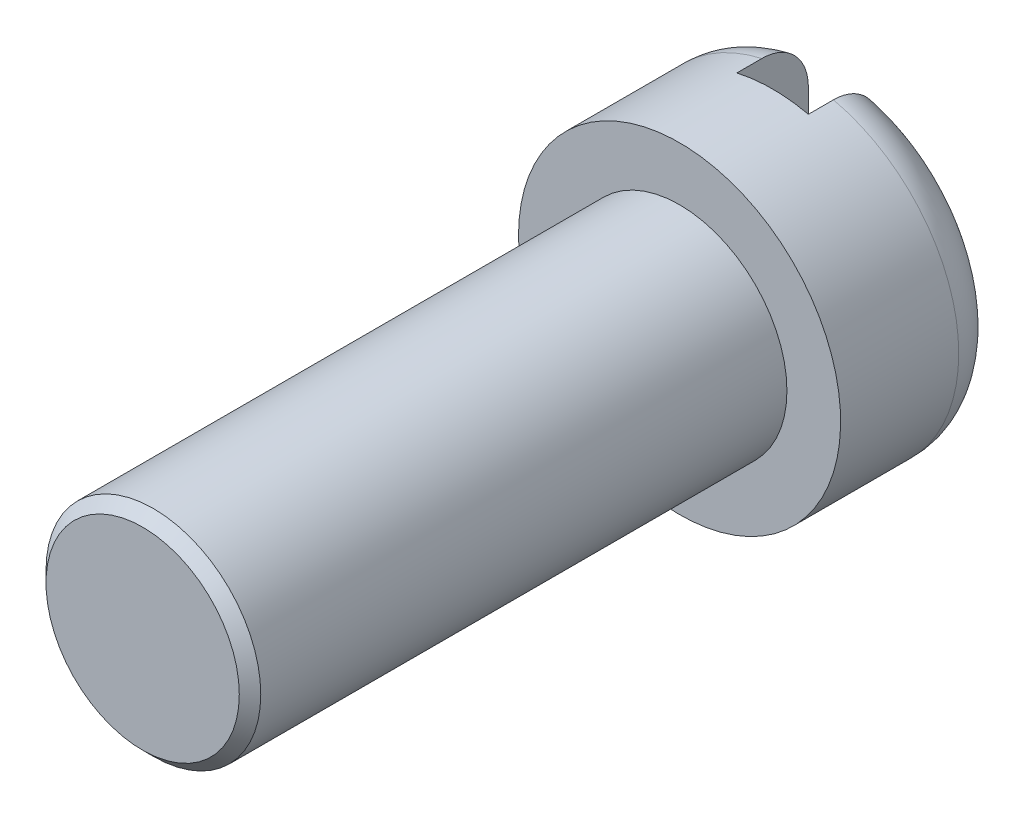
ISO-10303-21;
HEADER;
FILE_DESCRIPTION(('STEP AP214'),'2;1');
FILE_NAME('part.step','',(''),(''),'','','');
FILE_SCHEMA(('AUTOMOTIVE_DESIGN { 1 0 10303 214 1 1 1 1 }'));
ENDSEC;
DATA;
#1=APPLICATION_CONTEXT('core data for automotive mechanical design processes');
#2=APPLICATION_PROTOCOL_DEFINITION('international standard','automotive_design',2000,#1);
#3=PRODUCT_CONTEXT('',#1,'mechanical');
#4=PRODUCT('Part','Part','',(#3));
#5=PRODUCT_RELATED_PRODUCT_CATEGORY('part','',(#4));
#6=PRODUCT_DEFINITION_FORMATION('','',#4);
#7=PRODUCT_DEFINITION_CONTEXT('part definition',#1,'design');
#8=PRODUCT_DEFINITION('design','',#6,#7);
#9=PRODUCT_DEFINITION_SHAPE('','',#8);
#10=(LENGTH_UNIT() NAMED_UNIT(*) SI_UNIT(.MILLI.,.METRE.));
#11=(NAMED_UNIT(*) PLANE_ANGLE_UNIT() SI_UNIT($,.RADIAN.));
#12=(NAMED_UNIT(*) SI_UNIT($,.STERADIAN.) SOLID_ANGLE_UNIT());
#13=UNCERTAINTY_MEASURE_WITH_UNIT(LENGTH_MEASURE(1.E-05),#10,'distance_accuracy_value','');
#14=(GEOMETRIC_REPRESENTATION_CONTEXT(3) GLOBAL_UNCERTAINTY_ASSIGNED_CONTEXT((#13)) GLOBAL_UNIT_ASSIGNED_CONTEXT((#10,
#11,#12)) REPRESENTATION_CONTEXT('',''));
#15=CARTESIAN_POINT('',(0.,0.,0.));
#16=DIRECTION('',(0.,0.,1.));
#17=DIRECTION('',(1.,0.,0.));
#18=AXIS2_PLACEMENT_3D('',#15,#16,#17);
#19=CARTESIAN_POINT('',(0.,0.,-4.60000000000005));
#20=DIRECTION('',(0.,0.,-1.));
#21=DIRECTION('',(-1.,0.,0.));
#22=AXIS2_PLACEMENT_3D('',#19,#20,#21);
#23=PLANE('',#22);
#24=DIRECTION('',(0.,1.,0.));
#25=VECTOR('',#24,1.);
#26=CARTESIAN_POINT('',(-1.00000000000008,-2.22044604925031E-13,-4.60000000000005));
#27=LINE('',#26,#25);
#28=CARTESIAN_POINT('',(-1.00000000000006,-3.03973683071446,-4.60000000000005));
#29=VERTEX_POINT('',#28);
#30=CARTESIAN_POINT('',(-1.0000000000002,3.03973683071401,-4.60000000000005));
#31=VERTEX_POINT('',#30);
#32=EDGE_CURVE('E435',#29,#31,#27,.T.);
#33=ORIENTED_EDGE('',*,*,#32,.F.);
#34=CARTESIAN_POINT('',(0.,0.,-4.60000000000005));
#35=DIRECTION('',(0.,0.,-1.));
#36=DIRECTION('',(-1.,0.,0.));
#37=AXIS2_PLACEMENT_3D('',#34,#35,#36);
#38=CIRCLE('',#37,3.2);
#39=EDGE_CURVE('E509',#29,#31,#38,.T.);
#40=ORIENTED_EDGE('',*,*,#39,.T.);
#41=EDGE_LOOP('',(#33,#40));
#42=FACE_BOUND('',#41,.T.);
#43=ADVANCED_FACE('F348',(#42),#23,.T.);
#44=CARTESIAN_POINT('',(0.,0.,15.));
#45=DIRECTION('',(0.,0.,-1.));
#46=DIRECTION('',(-1.,0.,0.));
#47=AXIS2_PLACEMENT_3D('',#44,#45,#46);
#48=CYLINDRICAL_SURFACE('',#47,3.);
#49=CARTESIAN_POINT('',(0.,0.,14.7));
#50=DIRECTION('',(0.,0.,1.));
#51=DIRECTION('',(1.,0.,0.));
#52=AXIS2_PLACEMENT_3D('',#49,#50,#51);
#53=CIRCLE('',#52,3.);
#54=CARTESIAN_POINT('',(3.00000000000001,0.,14.7));
#55=VERTEX_POINT('',#54);
#56=EDGE_CURVE('E11',#55,#55,#53,.F.);
#57=ORIENTED_EDGE('',*,*,#56,.T.);
#58=EDGE_LOOP('',(#57));
#59=FACE_BOUND('',#58,.T.);
#60=CARTESIAN_POINT('',(0.,0.,0.));
#61=DIRECTION('',(0.,0.,-1.));
#62=DIRECTION('',(-1.,0.,0.));
#63=AXIS2_PLACEMENT_3D('',#60,#61,#62);
#64=CIRCLE('',#63,3.);
#65=CARTESIAN_POINT('',(-3.00000000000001,0.,0.));
#66=VERTEX_POINT('',#65);
#67=EDGE_CURVE('E503',#66,#66,#64,.T.);
#68=ORIENTED_EDGE('',*,*,#67,.F.);
#69=EDGE_LOOP('',(#68));
#70=FACE_BOUND('',#69,.T.);
#71=ADVANCED_FACE('F350',(#59,#70),#48,.T.);
#72=CARTESIAN_POINT('',(0.,0.,15.));
#73=DIRECTION('',(0.,0.,1.));
#74=DIRECTION('',(1.,0.,0.));
#75=AXIS2_PLACEMENT_3D('',#72,#73,#74);
#76=PLANE('',#75);
#77=CARTESIAN_POINT('',(0.,0.,15.));
#78=DIRECTION('',(0.,0.,1.));
#79=DIRECTION('',(1.,0.,0.));
#80=AXIS2_PLACEMENT_3D('',#77,#78,#79);
#81=CIRCLE('',#80,2.7);
#82=CARTESIAN_POINT('',(2.70000000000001,0.,15.));
#83=VERTEX_POINT('',#82);
#84=EDGE_CURVE('E356',#83,#83,#81,.T.);
#85=ORIENTED_EDGE('',*,*,#84,.T.);
#86=EDGE_LOOP('',(#85));
#87=FACE_BOUND('',#86,.T.);
#88=ADVANCED_FACE('F493',(#87),#76,.T.);
#89=CARTESIAN_POINT('',(0.,0.,0.));
#90=DIRECTION('',(0.,0.,-1.));
#91=DIRECTION('',(-1.,0.,0.));
#92=AXIS2_PLACEMENT_3D('',#89,#90,#91);
#93=PLANE('',#92);
#94=CARTESIAN_POINT('',(0.,0.,0.));
#95=DIRECTION('',(0.,0.,-1.));
#96=DIRECTION('',(-1.,0.,0.));
#97=AXIS2_PLACEMENT_3D('',#94,#95,#96);
#98=CIRCLE('',#97,4.5);
#99=CARTESIAN_POINT('',(-4.50000000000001,0.,0.));
#100=VERTEX_POINT('',#99);
#101=EDGE_CURVE('E513',#100,#100,#98,.T.);
#102=ORIENTED_EDGE('',*,*,#101,.F.);
#103=EDGE_LOOP('',(#102));
#104=FACE_BOUND('',#103,.T.);
#105=ORIENTED_EDGE('',*,*,#67,.T.);
#106=EDGE_LOOP('',(#105));
#107=FACE_BOUND('',#106,.T.);
#108=ADVANCED_FACE('F463',(#104,#107),#93,.F.);
#109=CARTESIAN_POINT('',(0.,0.,-4.60000000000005));
#110=DIRECTION('',(0.,0.,1.));
#111=DIRECTION('',(1.,0.,0.));
#112=AXIS2_PLACEMENT_3D('',#109,#110,#111);
#113=CYLINDRICAL_SURFACE('',#112,4.5);
#114=DIRECTION('',(0.,0.,1.));
#115=VECTOR('',#114,1.);
#116=CARTESIAN_POINT('',(1.00000000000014,-4.387482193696,-4.60000000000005));
#117=LINE('',#116,#115);
#118=CARTESIAN_POINT('',(1.00000000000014,-4.387482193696,-2.60000000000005));
#119=VERTEX_POINT('',#118);
#120=CARTESIAN_POINT('',(1.00000000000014,-4.387482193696,-3.29999999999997));
#121=VERTEX_POINT('',#120);
#122=EDGE_CURVE('E404',#119,#121,#117,.F.);
#123=ORIENTED_EDGE('',*,*,#122,.T.);
#124=CARTESIAN_POINT('',(0.,0.,-3.29999999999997));
#125=DIRECTION('',(0.,0.,-1.));
#126=DIRECTION('',(-1.,0.,0.));
#127=AXIS2_PLACEMENT_3D('',#124,#125,#126);
#128=CIRCLE('',#127,4.5);
#129=CARTESIAN_POINT('',(1.00000000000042,4.38748219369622,-3.29999999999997));
#130=VERTEX_POINT('',#129);
#131=EDGE_CURVE('E506',#121,#130,#128,.F.);
#132=ORIENTED_EDGE('',*,*,#131,.T.);
#133=DIRECTION('',(0.,0.,1.));
#134=VECTOR('',#133,1.);
#135=CARTESIAN_POINT('',(1.00000000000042,4.38748219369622,-4.60000000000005));
#136=LINE('',#135,#134);
#137=CARTESIAN_POINT('',(1.00000000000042,4.38748219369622,-2.60000000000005));
#138=VERTEX_POINT('',#137);
#139=EDGE_CURVE('E414',#130,#138,#136,.T.);
#140=ORIENTED_EDGE('',*,*,#139,.T.);
#141=CARTESIAN_POINT('',(0.,0.,-2.60000000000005));
#142=DIRECTION('',(0.,0.,1.));
#143=DIRECTION('',(1.,0.,0.));
#144=AXIS2_PLACEMENT_3D('',#141,#142,#143);
#145=CIRCLE('',#144,4.5);
#146=CARTESIAN_POINT('',(-0.999999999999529,4.38748219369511,-2.60000000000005));
#147=VERTEX_POINT('',#146);
#148=EDGE_CURVE('E424',#138,#147,#145,.T.);
#149=ORIENTED_EDGE('',*,*,#148,.T.);
#150=DIRECTION('',(0.,0.,1.));
#151=VECTOR('',#150,1.);
#152=CARTESIAN_POINT('',(-0.999999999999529,4.38748219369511,-4.60000000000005));
#153=LINE('',#152,#151);
#154=CARTESIAN_POINT('',(-0.999999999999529,4.38748219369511,-3.29999999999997));
#155=VERTEX_POINT('',#154);
#156=EDGE_CURVE('E511',#147,#155,#153,.F.);
#157=ORIENTED_EDGE('',*,*,#156,.T.);
#158=CARTESIAN_POINT('',(0.,0.,-3.29999999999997));
#159=DIRECTION('',(0.,0.,-1.));
#160=DIRECTION('',(-1.,0.,0.));
#161=AXIS2_PLACEMENT_3D('',#158,#159,#160);
#162=CIRCLE('',#161,4.5);
#163=CARTESIAN_POINT('',(-0.99999999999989,-4.38748219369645,-3.29999999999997));
#164=VERTEX_POINT('',#163);
#165=EDGE_CURVE('E507',#155,#164,#162,.F.);
#166=ORIENTED_EDGE('',*,*,#165,.T.);
#167=DIRECTION('',(0.,0.,1.));
#168=VECTOR('',#167,1.);
#169=CARTESIAN_POINT('',(-0.99999999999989,-4.38748219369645,-4.60000000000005));
#170=LINE('',#169,#168);
#171=CARTESIAN_POINT('',(-0.99999999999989,-4.38748219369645,-2.60000000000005));
#172=VERTEX_POINT('',#171);
#173=EDGE_CURVE('E429',#164,#172,#170,.T.);
#174=ORIENTED_EDGE('',*,*,#173,.T.);
#175=EDGE_CURVE('E421',#172,#119,#145,.T.);
#176=ORIENTED_EDGE('',*,*,#175,.T.);
#177=EDGE_LOOP('',(#123,#132,#140,#149,#157,#166,#174,#176));
#178=FACE_BOUND('',#177,.T.);
#179=ORIENTED_EDGE('',*,*,#101,.T.);
#180=EDGE_LOOP('',(#179));
#181=FACE_BOUND('',#180,.T.);
#182=ADVANCED_FACE('F427',(#178,#181),#113,.T.);
#183=DIRECTION('',(0.,-1.,0.));
#184=VECTOR('',#183,1.);
#185=CARTESIAN_POINT('',(1.00000000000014,0.,-4.60000000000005));
#186=LINE('',#185,#184);
#187=CARTESIAN_POINT('',(1.00000000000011,3.03973683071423,-4.60000000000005));
#188=VERTEX_POINT('',#187);
#189=CARTESIAN_POINT('',(1.00000000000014,-3.03973683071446,-4.60000000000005));
#190=VERTEX_POINT('',#189);
#191=EDGE_CURVE('E501',#188,#190,#186,.T.);
#192=ORIENTED_EDGE('',*,*,#191,.F.);
#193=CARTESIAN_POINT('',(0.,0.,-4.60000000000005));
#194=DIRECTION('',(0.,0.,-1.));
#195=DIRECTION('',(-1.,0.,0.));
#196=AXIS2_PLACEMENT_3D('',#193,#194,#195);
#197=CIRCLE('',#196,3.2);
#198=EDGE_CURVE('E430',#188,#190,#197,.T.);
#199=ORIENTED_EDGE('',*,*,#198,.T.);
#200=EDGE_LOOP('',(#192,#199));
#201=FACE_BOUND('',#200,.T.);
#202=ADVANCED_FACE('F459',(#201),#23,.T.);
#203=CARTESIAN_POINT('',(-1.00000000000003,-4.49999999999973,-2.60000000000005));
#204=DIRECTION('',(0.,0.,1.));
#205=DIRECTION('',(1.,0.,0.));
#206=AXIS2_PLACEMENT_3D('',#203,#204,#205);
#207=PLANE('',#206);
#208=DIRECTION('',(0.,1.,0.));
#209=VECTOR('',#208,1.);
#210=CARTESIAN_POINT('',(1.00000000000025,-4.49999999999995,-2.60000000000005));
#211=LINE('',#210,#209);
#212=EDGE_CURVE('E409',#119,#138,#211,.T.);
#213=ORIENTED_EDGE('',*,*,#212,.F.);
#214=ORIENTED_EDGE('',*,*,#175,.F.);
#215=DIRECTION('',(0.,1.,0.));
#216=VECTOR('',#215,1.);
#217=CARTESIAN_POINT('',(-1.00000000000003,-4.49999999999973,-2.60000000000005));
#218=LINE('',#217,#216);
#219=EDGE_CURVE('E425',#172,#147,#218,.T.);
#220=ORIENTED_EDGE('',*,*,#219,.T.);
#221=ORIENTED_EDGE('',*,*,#148,.F.);
#222=EDGE_LOOP('',(#213,#214,#220,#221));
#223=FACE_BOUND('',#222,.T.);
#224=ADVANCED_FACE('F419',(#223),#207,.F.);
#225=CARTESIAN_POINT('',(-1.00000000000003,-4.49999999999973,-4.60000000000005));
#226=DIRECTION('',(-1.,0.,0.));
#227=DIRECTION('',(0.,0.,1.));
#228=AXIS2_PLACEMENT_3D('',#225,#226,#227);
#229=PLANE('',#228);
#230=ORIENTED_EDGE('',*,*,#32,.T.);
#231=CARTESIAN_POINT('',(-1.0000000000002,3.03973683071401,-4.60000000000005));
#232=CARTESIAN_POINT('',(-1.00000000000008,3.07890629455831,-4.59999935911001));
#233=CARTESIAN_POINT('',(-1.00000000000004,3.1180598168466,-4.59840145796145));
#234=CARTESIAN_POINT('',(-1.00000000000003,3.19610894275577,-4.59198771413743));
#235=CARTESIAN_POINT('',(-1.00000000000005,3.23500449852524,-4.58717129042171));
#236=CARTESIAN_POINT('',(-1.00000000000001,3.35094848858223,-4.56785916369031));
#237=CARTESIAN_POINT('',(-0.99999999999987,3.42724939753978,-4.5485005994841));
#238=CARTESIAN_POINT('',(-0.999999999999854,3.57554026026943,-4.49704185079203));
#239=CARTESIAN_POINT('',(-0.999999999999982,3.64752309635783,-4.46492126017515));
#240=CARTESIAN_POINT('',(-1.00000000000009,3.78476641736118,-4.38865667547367));
#241=CARTESIAN_POINT('',(-1.00000000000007,3.85003242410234,-4.34452266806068));
#242=CARTESIAN_POINT('',(-1.00000000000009,3.96968488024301,-4.24704177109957));
#243=CARTESIAN_POINT('',(-1.00000000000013,4.02436130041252,-4.19405071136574));
#244=CARTESIAN_POINT('',(-0.999999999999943,4.12368593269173,-4.07934054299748));
#245=CARTESIAN_POINT('',(-0.99999999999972,4.16833217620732,-4.01761972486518));
#246=CARTESIAN_POINT('',(-0.999999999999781,4.24478221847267,-3.88944874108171));
#247=CARTESIAN_POINT('',(-1.00000000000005,4.27696116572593,-3.82322182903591));
#248=CARTESIAN_POINT('',(-1.00000000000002,4.3294538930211,-3.68625546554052));
#249=CARTESIAN_POINT('',(-0.999999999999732,4.34977974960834,-3.61552068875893));
#250=CARTESIAN_POINT('',(-0.999999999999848,4.37171475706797,-3.50348738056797));
#251=CARTESIAN_POINT('',(-1.,4.37762547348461,-3.46298491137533));
#252=CARTESIAN_POINT('',(-1.00000000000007,4.38550712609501,-3.38166148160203));
#253=CARTESIAN_POINT('',(-0.999999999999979,4.38748411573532,-3.34084110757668));
#254=CARTESIAN_POINT('',(-0.999999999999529,4.38748219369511,-3.29999999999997));
#255=B_SPLINE_CURVE_WITH_KNOTS('',3,(#231,#232,#233,#234,#235,#236,#237,#238,#239,#240,#241,
#242,#243,#244,#245,#246,#247,#248,#249,#250,#251,#252,#253,#254),.UNSPECIFIED.,.F.,.F.,(4,2,2,
2,2,2,2,2,2,2,2,4),(0.,0.117442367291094,0.23490594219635,0.469847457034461,0.705166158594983,
0.940289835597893,1.16758193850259,1.39491861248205,1.61475392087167,1.83436485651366,
1.95698842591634,2.07942314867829),.UNSPECIFIED.);
#256=EDGE_CURVE('E363',#31,#155,#255,.T.);
#257=ORIENTED_EDGE('',*,*,#256,.T.);
#258=ORIENTED_EDGE('',*,*,#156,.F.);
#259=ORIENTED_EDGE('',*,*,#219,.F.);
#260=ORIENTED_EDGE('',*,*,#173,.F.);
#261=CARTESIAN_POINT('',(-0.99999999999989,-4.38748219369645,-3.29999999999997));
#262=CARTESIAN_POINT('',(-0.999999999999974,-4.38748229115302,-3.33585122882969));
#263=CARTESIAN_POINT('',(-1.00000000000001,-4.38596012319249,-3.3716851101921));
#264=CARTESIAN_POINT('',(-1.00000000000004,-4.37988990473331,-3.44309259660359));
#265=CARTESIAN_POINT('',(-1.00000000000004,-4.37534211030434,-3.47866622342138));
#266=CARTESIAN_POINT('',(-1.00000000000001,-4.35721469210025,-3.58451089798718));
#267=CARTESIAN_POINT('',(-0.999999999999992,-4.33915084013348,-3.65406662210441));
#268=CARTESIAN_POINT('',(-1.00000000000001,-4.29162040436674,-3.78914528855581));
#269=CARTESIAN_POINT('',(-1.00000000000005,-4.26215040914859,-3.85466701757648));
#270=CARTESIAN_POINT('',(-1.00000000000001,-4.19271844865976,-3.97989520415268));
#271=CARTESIAN_POINT('',(-0.999999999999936,-4.15275661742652,-4.03960173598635));
#272=CARTESIAN_POINT('',(-0.999999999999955,-4.06316442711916,-4.15209265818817));
#273=CARTESIAN_POINT('',(-1.00000000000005,-4.01345378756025,-4.20481302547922));
#274=CARTESIAN_POINT('',(-1.00000000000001,-3.90606544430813,-4.30139306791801));
#275=CARTESIAN_POINT('',(-0.999999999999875,-3.84838672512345,-4.34525161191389));
#276=CARTESIAN_POINT('',(-0.999999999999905,-3.72527758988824,-4.42400866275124));
#277=CARTESIAN_POINT('',(-1.00000000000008,-3.65969596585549,-4.45867042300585));
#278=CARTESIAN_POINT('',(-0.999999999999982,-3.5237750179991,-4.51691414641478));
#279=CARTESIAN_POINT('',(-0.999999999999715,-3.45343510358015,-4.5404947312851));
#280=CARTESIAN_POINT('',(-0.99999999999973,-3.32578639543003,-4.57225411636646));
#281=CARTESIAN_POINT('',(-0.999999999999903,-3.26902305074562,-4.58268220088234));
#282=CARTESIAN_POINT('',(-1.00000000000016,-3.15475235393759,-4.59655592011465));
#283=CARTESIAN_POINT('',(-1.00000000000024,-3.09724654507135,-4.60001423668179));
#284=CARTESIAN_POINT('',(-1.00000000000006,-3.03973683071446,-4.60000000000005));
#285=B_SPLINE_CURVE_WITH_KNOTS('',3,(#261,#262,#263,#264,#265,#266,#267,#268,#269,#270,#271,
#272,#273,#274,#275,#276,#277,#278,#279,#280,#281,#282,#283,#284),.UNSPECIFIED.,.F.,.F.,(4,2,2,
2,2,2,2,2,2,2,2,4),(0.,0.107487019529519,0.214964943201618,0.429444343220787,0.643987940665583,
0.858528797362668,1.07491677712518,1.29133235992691,1.51287226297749,1.73443971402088,
1.90716550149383,2.07957672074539),.UNSPECIFIED.);
#286=EDGE_CURVE('E371',#164,#29,#285,.T.);
#287=ORIENTED_EDGE('',*,*,#286,.T.);
#288=EDGE_LOOP('',(#230,#257,#258,#259,#260,#287));
#289=FACE_BOUND('',#288,.T.);
#290=ADVANCED_FACE('F455',(#289),#229,.F.);
#291=CARTESIAN_POINT('',(1.00000000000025,-4.49999999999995,-4.60000000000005));
#292=DIRECTION('',(1.,0.,0.));
#293=DIRECTION('',(0.,0.,-1.));
#294=AXIS2_PLACEMENT_3D('',#291,#292,#293);
#295=PLANE('',#294);
#296=ORIENTED_EDGE('',*,*,#191,.T.);
#297=CARTESIAN_POINT('',(1.00000000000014,-3.03973683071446,-4.60000000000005));
#298=CARTESIAN_POINT('',(1.00000000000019,-3.07890629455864,-4.59999935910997));
#299=CARTESIAN_POINT('',(1.00000000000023,-3.11805981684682,-4.59840145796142));
#300=CARTESIAN_POINT('',(1.00000000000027,-3.19610894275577,-4.59198771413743));
#301=CARTESIAN_POINT('',(1.00000000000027,-3.23500449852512,-4.58717129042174));
#302=CARTESIAN_POINT('',(1.00000000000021,-3.35094848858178,-4.56785916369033));
#303=CARTESIAN_POINT('',(1.00000000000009,-3.42724939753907,-4.54850059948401));
#304=CARTESIAN_POINT('',(1.00000000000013,-3.57554026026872,-4.497041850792));
#305=CARTESIAN_POINT('',(1.00000000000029,-3.64752309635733,-4.46492126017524));
#306=CARTESIAN_POINT('',(1.00000000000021,-3.78476641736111,-4.38865667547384));
#307=CARTESIAN_POINT('',(0.999999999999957,-3.85003242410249,-4.34452266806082));
#308=CARTESIAN_POINT('',(0.999999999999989,-3.96968488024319,-4.24704177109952));
#309=CARTESIAN_POINT('',(1.00000000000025,-4.02436130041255,-4.19405071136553));
#310=CARTESIAN_POINT('',(1.00000000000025,-4.12368593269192,-4.07934054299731));
#311=CARTESIAN_POINT('',(0.999999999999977,-4.16833217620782,-4.01761972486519));
#312=CARTESIAN_POINT('',(1.00000000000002,-4.24478221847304,-3.88944874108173));
#313=CARTESIAN_POINT('',(1.00000000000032,-4.27696116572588,-3.82322182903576));
#314=CARTESIAN_POINT('',(1.00000000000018,-4.32945389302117,-3.68625546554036));
#315=CARTESIAN_POINT('',(0.999999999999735,-4.34977974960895,-3.61552068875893));
#316=CARTESIAN_POINT('',(0.99999999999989,-4.37171475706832,-3.50348738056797));
#317=CARTESIAN_POINT('',(1.00000000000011,-4.37762547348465,-3.46298491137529));
#318=CARTESIAN_POINT('',(1.00000000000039,-4.38550712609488,-3.38166148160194));
#319=CARTESIAN_POINT('',(1.00000000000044,-4.38748411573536,-3.34084110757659));
#320=CARTESIAN_POINT('',(1.00000000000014,-4.387482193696,-3.29999999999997));
#321=B_SPLINE_CURVE_WITH_KNOTS('',3,(#297,#298,#299,#300,#301,#302,#303,#304,#305,#306,#307,
#308,#309,#310,#311,#312,#313,#314,#315,#316,#317,#318,#319,#320),.UNSPECIFIED.,.F.,.F.,(4,2,2,
2,2,2,2,2,2,2,2,4),(0.,0.117442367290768,0.23490594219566,0.469847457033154,0.70516615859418,
0.940289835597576,1.16758193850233,1.39491861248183,1.61475392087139,1.83436485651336,
1.95698842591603,2.07942314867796),.UNSPECIFIED.);
#322=EDGE_CURVE('E410',#190,#121,#321,.T.);
#323=ORIENTED_EDGE('',*,*,#322,.T.);
#324=ORIENTED_EDGE('',*,*,#122,.F.);
#325=ORIENTED_EDGE('',*,*,#212,.T.);
#326=ORIENTED_EDGE('',*,*,#139,.F.);
#327=CARTESIAN_POINT('',(1.00000000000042,4.38748219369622,-3.29999999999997));
#328=CARTESIAN_POINT('',(1.00000000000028,4.38748229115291,-3.3358512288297));
#329=CARTESIAN_POINT('',(1.00000000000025,4.38596012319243,-3.37168511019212));
#330=CARTESIAN_POINT('',(1.00000000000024,4.37988990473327,-3.44309259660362));
#331=CARTESIAN_POINT('',(1.00000000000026,4.37534211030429,-3.47866622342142));
#332=CARTESIAN_POINT('',(1.0000000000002,4.35721469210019,-3.5845108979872));
#333=CARTESIAN_POINT('',(0.999999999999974,4.33915084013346,-3.65406662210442));
#334=CARTESIAN_POINT('',(0.999999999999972,4.29162040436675,-3.78914528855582));
#335=CARTESIAN_POINT('',(1.0000000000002,4.26215040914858,-3.85466701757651));
#336=CARTESIAN_POINT('',(1.00000000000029,4.19271844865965,-3.9798952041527));
#337=CARTESIAN_POINT('',(1.00000000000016,4.15275661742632,-4.03960173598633));
#338=CARTESIAN_POINT('',(1.00000000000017,4.06316442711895,-4.15209265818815));
#339=CARTESIAN_POINT('',(1.00000000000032,4.01345378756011,-4.20481302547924));
#340=CARTESIAN_POINT('',(1.00000000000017,3.90606544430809,-4.30139306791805));
#341=CARTESIAN_POINT('',(0.999999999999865,3.84838672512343,-4.34525161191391));
#342=CARTESIAN_POINT('',(0.99999999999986,3.72527758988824,-4.42400866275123));
#343=CARTESIAN_POINT('',(1.00000000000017,3.65969596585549,-4.45867042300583));
#344=CARTESIAN_POINT('',(1.00000000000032,3.5237750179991,-4.51691414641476));
#345=CARTESIAN_POINT('',(1.00000000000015,3.45343510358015,-4.54049473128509));
#346=CARTESIAN_POINT('',(1.00000000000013,3.32578639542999,-4.57225411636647));
#347=CARTESIAN_POINT('',(1.00000000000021,3.26902305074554,-4.58268220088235));
#348=CARTESIAN_POINT('',(1.00000000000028,3.15475235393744,-4.59655592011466));
#349=CARTESIAN_POINT('',(1.00000000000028,3.09724654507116,-4.60001423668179));
#350=CARTESIAN_POINT('',(1.00000000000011,3.03973683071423,-4.60000000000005));
#351=B_SPLINE_CURVE_WITH_KNOTS('',3,(#327,#328,#329,#330,#331,#332,#333,#334,#335,#336,#337,
#338,#339,#340,#341,#342,#343,#344,#345,#346,#347,#348,#349,#350),.UNSPECIFIED.,.F.,.F.,(4,2,2,
2,2,2,2,2,2,2,2,4),(0.,0.107487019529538,0.214964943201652,0.429444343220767,0.643987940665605,
0.858528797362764,1.07491677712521,1.29133235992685,1.51287226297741,1.73443971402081,
1.90716550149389,2.07957672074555),.UNSPECIFIED.);
#352=EDGE_CURVE('E433',#130,#188,#351,.T.);
#353=ORIENTED_EDGE('',*,*,#352,.T.);
#354=EDGE_LOOP('',(#296,#323,#324,#325,#326,#353));
#355=FACE_BOUND('',#354,.T.);
#356=ADVANCED_FACE('F407',(#355),#295,.F.);
#357=CARTESIAN_POINT('',(0.,0.,-3.29999999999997));
#358=DIRECTION('',(0.,0.,-1.));
#359=DIRECTION('',(-1.,0.,0.));
#360=AXIS2_PLACEMENT_3D('',#357,#358,#359);
#361=TOROIDAL_SURFACE('',#360,3.2,1.3);
#362=ORIENTED_EDGE('',*,*,#352,.F.);
#363=ORIENTED_EDGE('',*,*,#131,.F.);
#364=ORIENTED_EDGE('',*,*,#322,.F.);
#365=ORIENTED_EDGE('',*,*,#198,.F.);
#366=EDGE_LOOP('',(#362,#363,#364,#365));
#367=FACE_BOUND('',#366,.T.);
#368=ADVANCED_FACE('F449',(#367),#361,.T.);
#369=CARTESIAN_POINT('',(0.,0.,-3.29999999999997));
#370=DIRECTION('',(0.,0.,-1.));
#371=DIRECTION('',(-1.,0.,0.));
#372=AXIS2_PLACEMENT_3D('',#369,#370,#371);
#373=TOROIDAL_SURFACE('',#372,3.2,1.3);
#374=ORIENTED_EDGE('',*,*,#286,.F.);
#375=ORIENTED_EDGE('',*,*,#165,.F.);
#376=ORIENTED_EDGE('',*,*,#256,.F.);
#377=ORIENTED_EDGE('',*,*,#39,.F.);
#378=EDGE_LOOP('',(#374,#375,#376,#377));
#379=FACE_BOUND('',#378,.T.);
#380=ADVANCED_FACE('F475',(#379),#373,.T.);
#381=CARTESIAN_POINT('',(0.,0.,15.));
#382=DIRECTION('',(0.,0.,-1.));
#383=DIRECTION('',(-1.,0.,0.));
#384=AXIS2_PLACEMENT_3D('',#381,#382,#383);
#385=CONICAL_SURFACE('',#384,2.7,0.785398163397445);
#386=ORIENTED_EDGE('',*,*,#56,.F.);
#387=EDGE_LOOP('',(#386));
#388=FACE_BOUND('',#387,.T.);
#389=ORIENTED_EDGE('',*,*,#84,.F.);
#390=EDGE_LOOP('',(#389));
#391=FACE_BOUND('',#390,.T.);
#392=ADVANCED_FACE('F479',(#388,#391),#385,.T.);
#393=CLOSED_SHELL('',(#43,#71,#88,#108,#182,#202,#224,#290,#356,#368,#380,#392));
#394=MANIFOLD_SOLID_BREP('B2',#393);
#395=ADVANCED_BREP_SHAPE_REPRESENTATION('',(#18,#394),#14);
#396=SHAPE_DEFINITION_REPRESENTATION(#9,#395);
ENDSEC;
END-ISO-10303-21;
